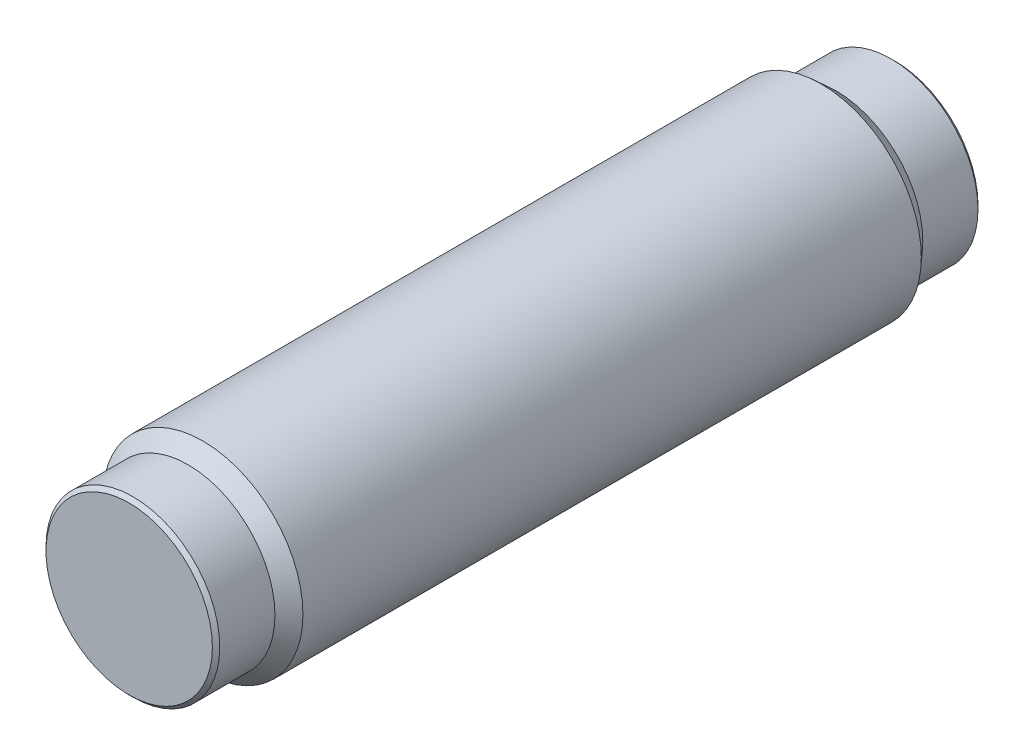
from build123d import *

# Parameters (mm, degrees)
SKETCH1_R           = 3.4
BOSS_EXTRUDE1_DEPTH = 10.5
CHAMFER1_SIZE       = 0.125


with BuildPart() as part:
    # Sketch1 → Boss-Extrude1 (new, symmetric)
    with BuildSketch(Plane.XY):
        with Locations(Location((0, 0, 0), (0, 0, 180))):
            Circle(SKETCH1_R)
    extrude(amount=BOSS_EXTRUDE1_DEPTH, both=True)

    # Sketch2 → Revolve1 (revolve)
    with BuildSketch(Plane(origin=(0, 0, 0), x_dir=(1, 0, 0), z_dir=(0, 1, 0))):
        Polygon((0, -10.5), (3.4, -10.5), (2.95, -11), (2.95, -13), (0, -13), align=None)
        Polygon((0, 13), (0, 10.5), (3.4, 10.5), (2.95, 11), (2.95, 13), align=None)
    revolve(axis=Axis((0, 0, 13), (0, 0, -1)))

    # Chamfer1
    chamfer1_edges = [part.edges().sort_by_distance(p)[0] for p in [
        (-2.95, 0, 13),
        (-2.95, 0, -13),
    ]]
    chamfer(chamfer1_edges, length=CHAMFER1_SIZE)


solid = part.part
